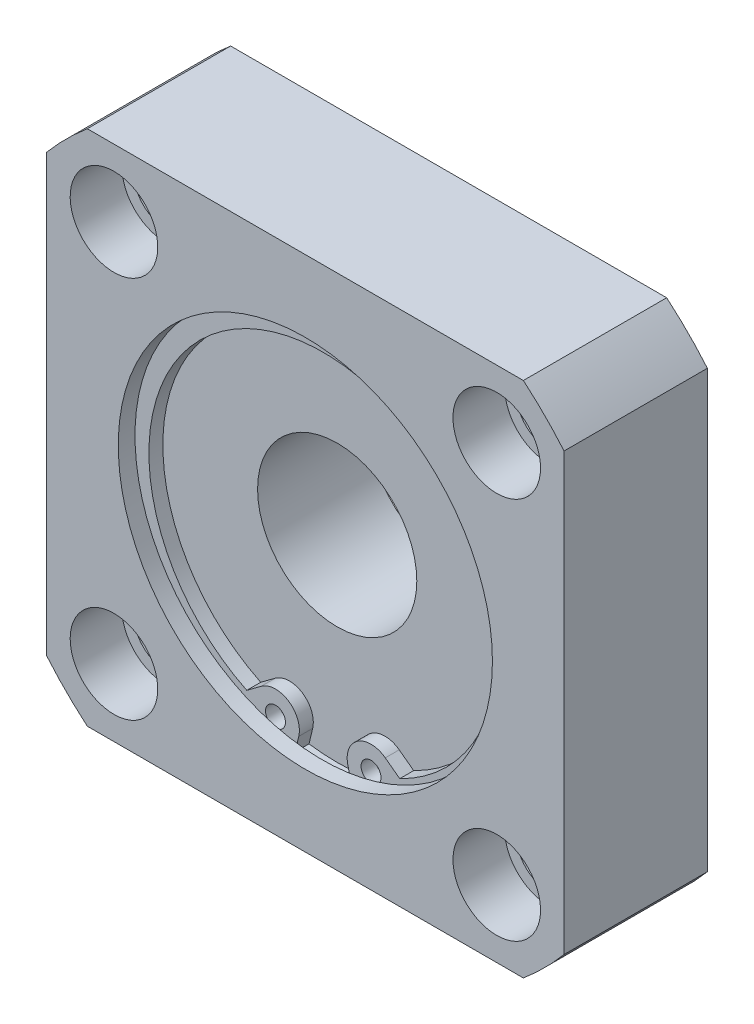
ISO-10303-21;
HEADER;
FILE_DESCRIPTION(('STEP AP214'),'2;1');
FILE_NAME('part.step','',(''),(''),'','','');
FILE_SCHEMA(('AUTOMOTIVE_DESIGN { 1 0 10303 214 1 1 1 1 }'));
ENDSEC;
DATA;
#1=APPLICATION_CONTEXT('core data for automotive mechanical design processes');
#2=APPLICATION_PROTOCOL_DEFINITION('international standard','automotive_design',2000,#1);
#3=PRODUCT_CONTEXT('',#1,'mechanical');
#4=PRODUCT('Part','Part','',(#3));
#5=PRODUCT_RELATED_PRODUCT_CATEGORY('part','',(#4));
#6=PRODUCT_DEFINITION_FORMATION('','',#4);
#7=PRODUCT_DEFINITION_CONTEXT('part definition',#1,'design');
#8=PRODUCT_DEFINITION('design','',#6,#7);
#9=PRODUCT_DEFINITION_SHAPE('','',#8);
#10=(LENGTH_UNIT() NAMED_UNIT(*) SI_UNIT(.MILLI.,.METRE.));
#11=(NAMED_UNIT(*) PLANE_ANGLE_UNIT() SI_UNIT($,.RADIAN.));
#12=(NAMED_UNIT(*) SI_UNIT($,.STERADIAN.) SOLID_ANGLE_UNIT());
#13=UNCERTAINTY_MEASURE_WITH_UNIT(LENGTH_MEASURE(1.E-05),#10,'distance_accuracy_value','');
#14=(GEOMETRIC_REPRESENTATION_CONTEXT(3) GLOBAL_UNCERTAINTY_ASSIGNED_CONTEXT((#13)) GLOBAL_UNIT_ASSIGNED_CONTEXT((#10,
#11,#12)) REPRESENTATION_CONTEXT('',''));
#15=CARTESIAN_POINT('',(0.,0.,0.));
#16=DIRECTION('',(0.,0.,1.));
#17=DIRECTION('',(1.,0.,0.));
#18=AXIS2_PLACEMENT_3D('',#15,#16,#17);
#19=CARTESIAN_POINT('',(24.0416305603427,24.0416305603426,0.));
#20=DIRECTION('',(0.,0.,1.));
#21=DIRECTION('',(1.,0.,0.));
#22=AXIS2_PLACEMENT_3D('',#19,#20,#21);
#23=CYLINDRICAL_SURFACE('',#22,4.);
#24=CARTESIAN_POINT('',(24.0416305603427,24.0416305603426,0.));
#25=DIRECTION('',(0.,0.,1.));
#26=DIRECTION('',(1.,0.,0.));
#27=AXIS2_PLACEMENT_3D('',#24,#25,#26);
#28=CIRCLE('',#27,4.);
#29=CARTESIAN_POINT('',(28.0416305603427,24.0416305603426,0.));
#30=VERTEX_POINT('',#29);
#31=EDGE_CURVE('E275',#30,#30,#28,.T.);
#32=ORIENTED_EDGE('',*,*,#31,.F.);
#33=EDGE_LOOP('',(#32));
#34=FACE_BOUND('',#33,.T.);
#35=CARTESIAN_POINT('',(24.0416305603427,24.0416305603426,11.5));
#36=DIRECTION('',(0.,0.,1.));
#37=DIRECTION('',(1.,0.,0.));
#38=AXIS2_PLACEMENT_3D('',#35,#36,#37);
#39=CIRCLE('',#38,4.);
#40=CARTESIAN_POINT('',(28.0416305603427,24.0416305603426,11.5));
#41=VERTEX_POINT('',#40);
#42=EDGE_CURVE('E274',#41,#41,#39,.F.);
#43=ORIENTED_EDGE('',*,*,#42,.F.);
#44=EDGE_LOOP('',(#43));
#45=FACE_BOUND('',#44,.T.);
#46=ADVANCED_FACE('F14',(#34,#45),#23,.F.);
#47=CARTESIAN_POINT('',(24.0416305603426,-24.0416305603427,0.));
#48=DIRECTION('',(0.,0.,1.));
#49=DIRECTION('',(1.,0.,0.));
#50=AXIS2_PLACEMENT_3D('',#47,#48,#49);
#51=CYLINDRICAL_SURFACE('',#50,4.);
#52=CARTESIAN_POINT('',(24.0416305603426,-24.0416305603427,0.));
#53=DIRECTION('',(0.,0.,1.));
#54=DIRECTION('',(0.,-1.,0.));
#55=AXIS2_PLACEMENT_3D('',#52,#53,#54);
#56=CIRCLE('',#55,4.);
#57=CARTESIAN_POINT('',(24.0416305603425,-28.0416305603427,0.));
#58=VERTEX_POINT('',#57);
#59=EDGE_CURVE('E265',#58,#58,#56,.T.);
#60=ORIENTED_EDGE('',*,*,#59,.F.);
#61=EDGE_LOOP('',(#60));
#62=FACE_BOUND('',#61,.T.);
#63=CARTESIAN_POINT('',(24.0416305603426,-24.0416305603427,11.5));
#64=DIRECTION('',(0.,0.,1.));
#65=DIRECTION('',(1.,0.,0.));
#66=AXIS2_PLACEMENT_3D('',#63,#64,#65);
#67=CIRCLE('',#66,4.);
#68=CARTESIAN_POINT('',(28.0416305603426,-24.0416305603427,11.5));
#69=VERTEX_POINT('',#68);
#70=EDGE_CURVE('E258',#69,#69,#67,.F.);
#71=ORIENTED_EDGE('',*,*,#70,.F.);
#72=EDGE_LOOP('',(#71));
#73=FACE_BOUND('',#72,.T.);
#74=ADVANCED_FACE('F474',(#62,#73),#51,.F.);
#75=CARTESIAN_POINT('',(-24.0416305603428,-24.0416305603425,0.));
#76=DIRECTION('',(0.,0.,1.));
#77=DIRECTION('',(1.,0.,0.));
#78=AXIS2_PLACEMENT_3D('',#75,#76,#77);
#79=CYLINDRICAL_SURFACE('',#78,4.);
#80=CARTESIAN_POINT('',(-24.0416305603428,-24.0416305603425,0.));
#81=DIRECTION('',(0.,0.,1.));
#82=DIRECTION('',(-1.,0.,0.));
#83=AXIS2_PLACEMENT_3D('',#80,#81,#82);
#84=CIRCLE('',#83,4.);
#85=CARTESIAN_POINT('',(-28.0416305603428,-24.0416305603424,0.));
#86=VERTEX_POINT('',#85);
#87=EDGE_CURVE('E262',#86,#86,#84,.T.);
#88=ORIENTED_EDGE('',*,*,#87,.F.);
#89=EDGE_LOOP('',(#88));
#90=FACE_BOUND('',#89,.T.);
#91=CARTESIAN_POINT('',(-24.0416305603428,-24.0416305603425,11.5));
#92=DIRECTION('',(0.,0.,1.));
#93=DIRECTION('',(1.,0.,0.));
#94=AXIS2_PLACEMENT_3D('',#91,#92,#93);
#95=CIRCLE('',#94,4.);
#96=CARTESIAN_POINT('',(-20.0416305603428,-24.0416305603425,11.5));
#97=VERTEX_POINT('',#96);
#98=EDGE_CURVE('E251',#97,#97,#95,.F.);
#99=ORIENTED_EDGE('',*,*,#98,.F.);
#100=EDGE_LOOP('',(#99));
#101=FACE_BOUND('',#100,.T.);
#102=ADVANCED_FACE('F486',(#90,#101),#79,.F.);
#103=CARTESIAN_POINT('',(-24.0416305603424,24.0416305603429,0.));
#104=DIRECTION('',(0.,0.,1.));
#105=DIRECTION('',(1.,0.,0.));
#106=AXIS2_PLACEMENT_3D('',#103,#104,#105);
#107=CYLINDRICAL_SURFACE('',#106,4.);
#108=CARTESIAN_POINT('',(-24.0416305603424,24.0416305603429,0.));
#109=DIRECTION('',(0.,0.,1.));
#110=DIRECTION('',(0.,1.,0.));
#111=AXIS2_PLACEMENT_3D('',#108,#109,#110);
#112=CIRCLE('',#111,4.);
#113=CARTESIAN_POINT('',(-24.0416305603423,28.0416305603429,0.));
#114=VERTEX_POINT('',#113);
#115=EDGE_CURVE('E259',#114,#114,#112,.T.);
#116=ORIENTED_EDGE('',*,*,#115,.F.);
#117=EDGE_LOOP('',(#116));
#118=FACE_BOUND('',#117,.T.);
#119=CARTESIAN_POINT('',(-24.0416305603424,24.0416305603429,11.5));
#120=DIRECTION('',(0.,0.,1.));
#121=DIRECTION('',(1.,0.,0.));
#122=AXIS2_PLACEMENT_3D('',#119,#120,#121);
#123=CIRCLE('',#122,4.);
#124=CARTESIAN_POINT('',(-20.0416305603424,24.0416305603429,11.5));
#125=VERTEX_POINT('',#124);
#126=EDGE_CURVE('E244',#125,#125,#123,.F.);
#127=ORIENTED_EDGE('',*,*,#126,.F.);
#128=EDGE_LOOP('',(#127));
#129=FACE_BOUND('',#128,.T.);
#130=ADVANCED_FACE('F490',(#118,#129),#107,.F.);
#131=CARTESIAN_POINT('',(0.,0.,-5.));
#132=DIRECTION('',(0.,0.,1.));
#133=DIRECTION('',(1.,0.,0.));
#134=AXIS2_PLACEMENT_3D('',#131,#132,#133);
#135=CYLINDRICAL_SURFACE('',#134,27.);
#136=CARTESIAN_POINT('',(0.,0.,-5.));
#137=DIRECTION('',(0.,0.,-1.));
#138=DIRECTION('',(-1.,0.,0.));
#139=AXIS2_PLACEMENT_3D('',#136,#137,#138);
#140=CIRCLE('',#139,27.);
#141=CARTESIAN_POINT('',(-27.,0.,-5.));
#142=VERTEX_POINT('',#141);
#143=EDGE_CURVE('E226',#142,#142,#140,.T.);
#144=ORIENTED_EDGE('',*,*,#143,.F.);
#145=EDGE_LOOP('',(#144));
#146=FACE_BOUND('',#145,.T.);
#147=CARTESIAN_POINT('',(0.,0.,0.));
#148=DIRECTION('',(0.,0.,-1.));
#149=DIRECTION('',(-1.,0.,0.));
#150=AXIS2_PLACEMENT_3D('',#147,#148,#149);
#151=CIRCLE('',#150,27.);
#152=CARTESIAN_POINT('',(-27.,0.,0.));
#153=VERTEX_POINT('',#152);
#154=EDGE_CURVE('E227',#153,#153,#151,.T.);
#155=ORIENTED_EDGE('',*,*,#154,.T.);
#156=EDGE_LOOP('',(#155));
#157=FACE_BOUND('',#156,.T.);
#158=ADVANCED_FACE('F465',(#146,#157),#135,.T.);
#159=CARTESIAN_POINT('',(0.,0.,0.));
#160=DIRECTION('',(0.,0.,-1.));
#161=DIRECTION('',(-1.,0.,0.));
#162=AXIS2_PLACEMENT_3D('',#159,#160,#161);
#163=PLANE('',#162);
#164=ORIENTED_EDGE('',*,*,#154,.F.);
#165=EDGE_LOOP('',(#164));
#166=FACE_BOUND('',#165,.T.);
#167=ORIENTED_EDGE('',*,*,#115,.T.);
#168=EDGE_LOOP('',(#167));
#169=FACE_BOUND('',#168,.T.);
#170=ORIENTED_EDGE('',*,*,#87,.T.);
#171=EDGE_LOOP('',(#170));
#172=FACE_BOUND('',#171,.T.);
#173=ORIENTED_EDGE('',*,*,#59,.T.);
#174=EDGE_LOOP('',(#173));
#175=FACE_BOUND('',#174,.T.);
#176=ORIENTED_EDGE('',*,*,#31,.T.);
#177=EDGE_LOOP('',(#176));
#178=FACE_BOUND('',#177,.T.);
#179=CARTESIAN_POINT('',(0.,0.,0.));
#180=DIRECTION('',(0.,0.,-1.));
#181=DIRECTION('',(-1.,0.,0.));
#182=AXIS2_PLACEMENT_3D('',#179,#180,#181);
#183=CIRCLE('',#182,42.5);
#184=CARTESIAN_POINT('',(32.5,-27.3861278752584,0.));
#185=VERTEX_POINT('',#184);
#186=CARTESIAN_POINT('',(27.3861278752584,-32.5,0.));
#187=VERTEX_POINT('',#186);
#188=EDGE_CURVE('E281',#185,#187,#183,.T.);
#189=ORIENTED_EDGE('',*,*,#188,.T.);
#190=DIRECTION('',(1.,0.,0.));
#191=VECTOR('',#190,1.);
#192=CARTESIAN_POINT('',(-27.3861278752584,-32.5,0.));
#193=LINE('',#192,#191);
#194=CARTESIAN_POINT('',(-27.3861278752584,-32.5,0.));
#195=VERTEX_POINT('',#194);
#196=EDGE_CURVE('E283',#195,#187,#193,.T.);
#197=ORIENTED_EDGE('',*,*,#196,.F.);
#198=CARTESIAN_POINT('',(0.,0.,0.));
#199=DIRECTION('',(0.,0.,1.));
#200=DIRECTION('',(1.,0.,0.));
#201=AXIS2_PLACEMENT_3D('',#198,#199,#200);
#202=CIRCLE('',#201,42.5);
#203=CARTESIAN_POINT('',(-32.5,-27.3861278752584,0.));
#204=VERTEX_POINT('',#203);
#205=EDGE_CURVE('E286',#204,#195,#202,.T.);
#206=ORIENTED_EDGE('',*,*,#205,.F.);
#207=DIRECTION('',(0.,-1.,0.));
#208=VECTOR('',#207,1.);
#209=CARTESIAN_POINT('',(-32.5,27.3861278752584,0.));
#210=LINE('',#209,#208);
#211=CARTESIAN_POINT('',(-32.5,27.3861278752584,0.));
#212=VERTEX_POINT('',#211);
#213=EDGE_CURVE('E289',#212,#204,#210,.T.);
#214=ORIENTED_EDGE('',*,*,#213,.F.);
#215=CARTESIAN_POINT('',(0.,0.,0.));
#216=DIRECTION('',(0.,0.,-1.));
#217=DIRECTION('',(-1.,0.,0.));
#218=AXIS2_PLACEMENT_3D('',#215,#216,#217);
#219=CIRCLE('',#218,42.5);
#220=CARTESIAN_POINT('',(-27.3861278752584,32.5,0.));
#221=VERTEX_POINT('',#220);
#222=EDGE_CURVE('E292',#212,#221,#219,.T.);
#223=ORIENTED_EDGE('',*,*,#222,.T.);
#224=DIRECTION('',(1.,0.,0.));
#225=VECTOR('',#224,1.);
#226=CARTESIAN_POINT('',(-27.3861278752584,32.5,0.));
#227=LINE('',#226,#225);
#228=CARTESIAN_POINT('',(27.3861278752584,32.5,0.));
#229=VERTEX_POINT('',#228);
#230=EDGE_CURVE('E295',#221,#229,#227,.T.);
#231=ORIENTED_EDGE('',*,*,#230,.T.);
#232=CARTESIAN_POINT('',(0.,0.,0.));
#233=DIRECTION('',(0.,0.,1.));
#234=DIRECTION('',(1.,0.,0.));
#235=AXIS2_PLACEMENT_3D('',#232,#233,#234);
#236=CIRCLE('',#235,42.5);
#237=CARTESIAN_POINT('',(32.5,27.3861278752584,0.));
#238=VERTEX_POINT('',#237);
#239=EDGE_CURVE('E298',#238,#229,#236,.T.);
#240=ORIENTED_EDGE('',*,*,#239,.F.);
#241=DIRECTION('',(0.,-1.,0.));
#242=VECTOR('',#241,1.);
#243=CARTESIAN_POINT('',(32.5,27.3861278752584,0.));
#244=LINE('',#243,#242);
#245=EDGE_CURVE('E301',#238,#185,#244,.T.);
#246=ORIENTED_EDGE('',*,*,#245,.T.);
#247=EDGE_LOOP('',(#189,#197,#206,#214,#223,#231,#240,#246));
#248=FACE_BOUND('',#247,.T.);
#249=ADVANCED_FACE('F461',(#166,#169,#172,#175,#178,#248),#163,.T.);
#250=CARTESIAN_POINT('',(24.0416305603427,24.0416305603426,11.5));
#251=DIRECTION('',(0.,0.,1.));
#252=DIRECTION('',(1.,0.,0.));
#253=AXIS2_PLACEMENT_3D('',#250,#251,#252);
#254=PLANE('',#253);
#255=CARTESIAN_POINT('',(24.0416305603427,24.0416305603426,11.5));
#256=DIRECTION('',(0.,0.,1.));
#257=DIRECTION('',(1.,0.,0.));
#258=AXIS2_PLACEMENT_3D('',#255,#256,#257);
#259=CIRCLE('',#258,5.5);
#260=CARTESIAN_POINT('',(29.5416305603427,24.0416305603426,11.5));
#261=VERTEX_POINT('',#260);
#262=EDGE_CURVE('E271',#261,#261,#259,.T.);
#263=ORIENTED_EDGE('',*,*,#262,.T.);
#264=EDGE_LOOP('',(#263));
#265=FACE_BOUND('',#264,.T.);
#266=ORIENTED_EDGE('',*,*,#42,.T.);
#267=EDGE_LOOP('',(#266));
#268=FACE_BOUND('',#267,.T.);
#269=ADVANCED_FACE('F464',(#265,#268),#254,.T.);
#270=CARTESIAN_POINT('',(24.0416305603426,-24.0416305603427,11.5));
#271=DIRECTION('',(0.,0.,1.));
#272=DIRECTION('',(0.,-1.,0.));
#273=AXIS2_PLACEMENT_3D('',#270,#271,#272);
#274=PLANE('',#273);
#275=CARTESIAN_POINT('',(24.0416305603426,-24.0416305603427,11.5));
#276=DIRECTION('',(0.,0.,1.));
#277=DIRECTION('',(0.,-1.,0.));
#278=AXIS2_PLACEMENT_3D('',#275,#276,#277);
#279=CIRCLE('',#278,5.5);
#280=CARTESIAN_POINT('',(24.0416305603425,-29.5416305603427,11.5));
#281=VERTEX_POINT('',#280);
#282=EDGE_CURVE('E255',#281,#281,#279,.T.);
#283=ORIENTED_EDGE('',*,*,#282,.T.);
#284=EDGE_LOOP('',(#283));
#285=FACE_BOUND('',#284,.T.);
#286=ORIENTED_EDGE('',*,*,#70,.T.);
#287=EDGE_LOOP('',(#286));
#288=FACE_BOUND('',#287,.T.);
#289=ADVANCED_FACE('F482',(#285,#288),#274,.T.);
#290=CARTESIAN_POINT('',(-24.0416305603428,-24.0416305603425,11.5));
#291=DIRECTION('',(0.,0.,1.));
#292=DIRECTION('',(-1.,0.,0.));
#293=AXIS2_PLACEMENT_3D('',#290,#291,#292);
#294=PLANE('',#293);
#295=CARTESIAN_POINT('',(-24.0416305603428,-24.0416305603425,11.5));
#296=DIRECTION('',(0.,0.,1.));
#297=DIRECTION('',(-1.,0.,0.));
#298=AXIS2_PLACEMENT_3D('',#295,#296,#297);
#299=CIRCLE('',#298,5.5);
#300=CARTESIAN_POINT('',(-29.5416305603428,-24.0416305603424,11.5));
#301=VERTEX_POINT('',#300);
#302=EDGE_CURVE('E248',#301,#301,#299,.T.);
#303=ORIENTED_EDGE('',*,*,#302,.T.);
#304=EDGE_LOOP('',(#303));
#305=FACE_BOUND('',#304,.T.);
#306=ORIENTED_EDGE('',*,*,#98,.T.);
#307=EDGE_LOOP('',(#306));
#308=FACE_BOUND('',#307,.T.);
#309=ADVANCED_FACE('F501',(#305,#308),#294,.T.);
#310=CARTESIAN_POINT('',(-24.0416305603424,24.0416305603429,11.5));
#311=DIRECTION('',(0.,0.,1.));
#312=DIRECTION('',(0.,1.,0.));
#313=AXIS2_PLACEMENT_3D('',#310,#311,#312);
#314=PLANE('',#313);
#315=CARTESIAN_POINT('',(-24.0416305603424,24.0416305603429,11.5));
#316=DIRECTION('',(0.,0.,1.));
#317=DIRECTION('',(0.,1.,0.));
#318=AXIS2_PLACEMENT_3D('',#315,#316,#317);
#319=CIRCLE('',#318,5.5);
#320=CARTESIAN_POINT('',(-24.0416305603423,29.5416305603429,11.5));
#321=VERTEX_POINT('',#320);
#322=EDGE_CURVE('E241',#321,#321,#319,.T.);
#323=ORIENTED_EDGE('',*,*,#322,.T.);
#324=EDGE_LOOP('',(#323));
#325=FACE_BOUND('',#324,.T.);
#326=ORIENTED_EDGE('',*,*,#126,.T.);
#327=EDGE_LOOP('',(#326));
#328=FACE_BOUND('',#327,.T.);
#329=ADVANCED_FACE('F509',(#325,#328),#314,.T.);
#330=CARTESIAN_POINT('',(0.,0.,-5.));
#331=DIRECTION('',(0.,0.,-1.));
#332=DIRECTION('',(-1.,0.,0.));
#333=AXIS2_PLACEMENT_3D('',#330,#331,#332);
#334=PLANE('',#333);
#335=ORIENTED_EDGE('',*,*,#143,.T.);
#336=EDGE_LOOP('',(#335));
#337=FACE_BOUND('',#336,.T.);
#338=CARTESIAN_POINT('',(0.,0.,-5.));
#339=DIRECTION('',(0.,0.,-1.));
#340=DIRECTION('',(-1.,0.,0.));
#341=AXIS2_PLACEMENT_3D('',#338,#339,#340);
#342=CIRCLE('',#341,20.);
#343=CARTESIAN_POINT('',(-20.,0.,-5.));
#344=VERTEX_POINT('',#343);
#345=EDGE_CURVE('E223',#344,#344,#342,.T.);
#346=ORIENTED_EDGE('',*,*,#345,.F.);
#347=EDGE_LOOP('',(#346));
#348=FACE_BOUND('',#347,.T.);
#349=ADVANCED_FACE('F450',(#337,#348),#334,.T.);
#350=CARTESIAN_POINT('',(-27.3861278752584,-32.5,18.));
#351=DIRECTION('',(0.,1.,0.));
#352=DIRECTION('',(0.,0.,1.));
#353=AXIS2_PLACEMENT_3D('',#350,#351,#352);
#354=PLANE('',#353);
#355=DIRECTION('',(1.,0.,0.));
#356=VECTOR('',#355,1.);
#357=CARTESIAN_POINT('',(-27.3861278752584,-32.5,18.));
#358=LINE('',#357,#356);
#359=CARTESIAN_POINT('',(-27.3861278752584,-32.5,18.));
#360=VERTEX_POINT('',#359);
#361=CARTESIAN_POINT('',(27.3861278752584,-32.5,18.));
#362=VERTEX_POINT('',#361);
#363=EDGE_CURVE('E306',#360,#362,#358,.T.);
#364=ORIENTED_EDGE('',*,*,#363,.F.);
#365=DIRECTION('',(0.,0.,-1.));
#366=VECTOR('',#365,1.);
#367=CARTESIAN_POINT('',(-27.3861278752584,-32.5,18.));
#368=LINE('',#367,#366);
#369=EDGE_CURVE('E328',#360,#195,#368,.T.);
#370=ORIENTED_EDGE('',*,*,#369,.T.);
#371=ORIENTED_EDGE('',*,*,#196,.T.);
#372=DIRECTION('',(0.,0.,-1.));
#373=VECTOR('',#372,1.);
#374=CARTESIAN_POINT('',(27.3861278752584,-32.5,18.));
#375=LINE('',#374,#373);
#376=EDGE_CURVE('E74',#362,#187,#375,.T.);
#377=ORIENTED_EDGE('',*,*,#376,.F.);
#378=EDGE_LOOP('',(#364,#370,#371,#377));
#379=FACE_BOUND('',#378,.T.);
#380=ADVANCED_FACE('F446',(#379),#354,.F.);
#381=CARTESIAN_POINT('',(0.,0.,18.));
#382=DIRECTION('',(0.,0.,-1.));
#383=DIRECTION('',(-1.,0.,0.));
#384=AXIS2_PLACEMENT_3D('',#381,#382,#383);
#385=CYLINDRICAL_SURFACE('',#384,42.5);
#386=ORIENTED_EDGE('',*,*,#369,.F.);
#387=CARTESIAN_POINT('',(0.,0.,18.));
#388=DIRECTION('',(0.,0.,1.));
#389=DIRECTION('',(1.,0.,0.));
#390=AXIS2_PLACEMENT_3D('',#387,#388,#389);
#391=CIRCLE('',#390,42.5);
#392=CARTESIAN_POINT('',(-32.5,-27.3861278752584,18.));
#393=VERTEX_POINT('',#392);
#394=EDGE_CURVE('E309',#393,#360,#391,.T.);
#395=ORIENTED_EDGE('',*,*,#394,.F.);
#396=DIRECTION('',(0.,0.,-1.));
#397=VECTOR('',#396,1.);
#398=CARTESIAN_POINT('',(-32.5,-27.3861278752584,18.));
#399=LINE('',#398,#397);
#400=EDGE_CURVE('E330',#393,#204,#399,.T.);
#401=ORIENTED_EDGE('',*,*,#400,.T.);
#402=ORIENTED_EDGE('',*,*,#205,.T.);
#403=EDGE_LOOP('',(#386,#395,#401,#402));
#404=FACE_BOUND('',#403,.T.);
#405=ADVANCED_FACE('F442',(#404),#385,.T.);
#406=CARTESIAN_POINT('',(-32.5,27.3861278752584,18.));
#407=DIRECTION('',(1.,0.,0.));
#408=DIRECTION('',(0.,0.,-1.));
#409=AXIS2_PLACEMENT_3D('',#406,#407,#408);
#410=PLANE('',#409);
#411=ORIENTED_EDGE('',*,*,#400,.F.);
#412=DIRECTION('',(0.,-1.,0.));
#413=VECTOR('',#412,1.);
#414=CARTESIAN_POINT('',(-32.5,27.3861278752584,18.));
#415=LINE('',#414,#413);
#416=CARTESIAN_POINT('',(-32.5,27.3861278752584,18.));
#417=VERTEX_POINT('',#416);
#418=EDGE_CURVE('E312',#417,#393,#415,.T.);
#419=ORIENTED_EDGE('',*,*,#418,.F.);
#420=DIRECTION('',(0.,0.,-1.));
#421=VECTOR('',#420,1.);
#422=CARTESIAN_POINT('',(-32.5,27.3861278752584,18.));
#423=LINE('',#422,#421);
#424=EDGE_CURVE('E332',#417,#212,#423,.T.);
#425=ORIENTED_EDGE('',*,*,#424,.T.);
#426=ORIENTED_EDGE('',*,*,#213,.T.);
#427=EDGE_LOOP('',(#411,#419,#425,#426));
#428=FACE_BOUND('',#427,.T.);
#429=ADVANCED_FACE('F438',(#428),#410,.F.);
#430=CARTESIAN_POINT('',(0.,0.,18.));
#431=DIRECTION('',(0.,0.,-1.));
#432=DIRECTION('',(-1.,0.,0.));
#433=AXIS2_PLACEMENT_3D('',#430,#431,#432);
#434=CYLINDRICAL_SURFACE('',#433,42.5);
#435=ORIENTED_EDGE('',*,*,#424,.F.);
#436=CARTESIAN_POINT('',(0.,0.,18.));
#437=DIRECTION('',(0.,0.,-1.));
#438=DIRECTION('',(-1.,0.,0.));
#439=AXIS2_PLACEMENT_3D('',#436,#437,#438);
#440=CIRCLE('',#439,42.5);
#441=CARTESIAN_POINT('',(-27.3861278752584,32.5,18.));
#442=VERTEX_POINT('',#441);
#443=EDGE_CURVE('E315',#417,#442,#440,.T.);
#444=ORIENTED_EDGE('',*,*,#443,.T.);
#445=DIRECTION('',(0.,0.,-1.));
#446=VECTOR('',#445,1.);
#447=CARTESIAN_POINT('',(-27.3861278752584,32.5,18.));
#448=LINE('',#447,#446);
#449=EDGE_CURVE('E334',#442,#221,#448,.T.);
#450=ORIENTED_EDGE('',*,*,#449,.T.);
#451=ORIENTED_EDGE('',*,*,#222,.F.);
#452=EDGE_LOOP('',(#435,#444,#450,#451));
#453=FACE_BOUND('',#452,.T.);
#454=ADVANCED_FACE('F434',(#453),#434,.T.);
#455=CARTESIAN_POINT('',(-27.3861278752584,32.5,18.));
#456=DIRECTION('',(0.,1.,0.));
#457=DIRECTION('',(0.,0.,1.));
#458=AXIS2_PLACEMENT_3D('',#455,#456,#457);
#459=PLANE('',#458);
#460=ORIENTED_EDGE('',*,*,#449,.F.);
#461=DIRECTION('',(1.,0.,0.));
#462=VECTOR('',#461,1.);
#463=CARTESIAN_POINT('',(-27.3861278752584,32.5,18.));
#464=LINE('',#463,#462);
#465=CARTESIAN_POINT('',(27.3861278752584,32.5,18.));
#466=VERTEX_POINT('',#465);
#467=EDGE_CURVE('E318',#442,#466,#464,.T.);
#468=ORIENTED_EDGE('',*,*,#467,.T.);
#469=DIRECTION('',(0.,0.,-1.));
#470=VECTOR('',#469,1.);
#471=CARTESIAN_POINT('',(27.3861278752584,32.5,18.));
#472=LINE('',#471,#470);
#473=EDGE_CURVE('E336',#466,#229,#472,.T.);
#474=ORIENTED_EDGE('',*,*,#473,.T.);
#475=ORIENTED_EDGE('',*,*,#230,.F.);
#476=EDGE_LOOP('',(#460,#468,#474,#475));
#477=FACE_BOUND('',#476,.T.);
#478=ADVANCED_FACE('F430',(#477),#459,.T.);
#479=CARTESIAN_POINT('',(0.,0.,18.));
#480=DIRECTION('',(0.,0.,-1.));
#481=DIRECTION('',(-1.,0.,0.));
#482=AXIS2_PLACEMENT_3D('',#479,#480,#481);
#483=CYLINDRICAL_SURFACE('',#482,42.5);
#484=ORIENTED_EDGE('',*,*,#473,.F.);
#485=CARTESIAN_POINT('',(0.,0.,18.));
#486=DIRECTION('',(0.,0.,1.));
#487=DIRECTION('',(1.,0.,0.));
#488=AXIS2_PLACEMENT_3D('',#485,#486,#487);
#489=CIRCLE('',#488,42.5);
#490=CARTESIAN_POINT('',(32.5,27.3861278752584,18.));
#491=VERTEX_POINT('',#490);
#492=EDGE_CURVE('E321',#491,#466,#489,.T.);
#493=ORIENTED_EDGE('',*,*,#492,.F.);
#494=DIRECTION('',(0.,0.,-1.));
#495=VECTOR('',#494,1.);
#496=CARTESIAN_POINT('',(32.5,27.3861278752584,18.));
#497=LINE('',#496,#495);
#498=EDGE_CURVE('E338',#491,#238,#497,.T.);
#499=ORIENTED_EDGE('',*,*,#498,.T.);
#500=ORIENTED_EDGE('',*,*,#239,.T.);
#501=EDGE_LOOP('',(#484,#493,#499,#500));
#502=FACE_BOUND('',#501,.T.);
#503=ADVANCED_FACE('F426',(#502),#483,.T.);
#504=CARTESIAN_POINT('',(32.5,27.3861278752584,18.));
#505=DIRECTION('',(1.,0.,0.));
#506=DIRECTION('',(0.,0.,-1.));
#507=AXIS2_PLACEMENT_3D('',#504,#505,#506);
#508=PLANE('',#507);
#509=ORIENTED_EDGE('',*,*,#498,.F.);
#510=DIRECTION('',(0.,-1.,0.));
#511=VECTOR('',#510,1.);
#512=CARTESIAN_POINT('',(32.5,27.3861278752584,18.));
#513=LINE('',#512,#511);
#514=CARTESIAN_POINT('',(32.5,-27.3861278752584,18.));
#515=VERTEX_POINT('',#514);
#516=EDGE_CURVE('E324',#491,#515,#513,.T.);
#517=ORIENTED_EDGE('',*,*,#516,.T.);
#518=DIRECTION('',(0.,0.,-1.));
#519=VECTOR('',#518,1.);
#520=CARTESIAN_POINT('',(32.5,-27.3861278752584,18.));
#521=LINE('',#520,#519);
#522=EDGE_CURVE('E231',#515,#185,#521,.T.);
#523=ORIENTED_EDGE('',*,*,#522,.T.);
#524=ORIENTED_EDGE('',*,*,#245,.F.);
#525=EDGE_LOOP('',(#509,#517,#523,#524));
#526=FACE_BOUND('',#525,.T.);
#527=ADVANCED_FACE('F422',(#526),#508,.T.);
#528=CARTESIAN_POINT('',(0.,0.,18.));
#529=DIRECTION('',(0.,0.,-1.));
#530=DIRECTION('',(-1.,0.,0.));
#531=AXIS2_PLACEMENT_3D('',#528,#529,#530);
#532=CYLINDRICAL_SURFACE('',#531,42.5);
#533=ORIENTED_EDGE('',*,*,#522,.F.);
#534=CARTESIAN_POINT('',(0.,0.,18.));
#535=DIRECTION('',(0.,0.,-1.));
#536=DIRECTION('',(-1.,0.,0.));
#537=AXIS2_PLACEMENT_3D('',#534,#535,#536);
#538=CIRCLE('',#537,42.5);
#539=EDGE_CURVE('E304',#515,#362,#538,.T.);
#540=ORIENTED_EDGE('',*,*,#539,.T.);
#541=ORIENTED_EDGE('',*,*,#376,.T.);
#542=ORIENTED_EDGE('',*,*,#188,.F.);
#543=EDGE_LOOP('',(#533,#540,#541,#542));
#544=FACE_BOUND('',#543,.T.);
#545=ADVANCED_FACE('F425',(#544),#532,.T.);
#546=CARTESIAN_POINT('',(24.0416305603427,24.0416305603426,11.5));
#547=DIRECTION('',(0.,0.,1.));
#548=DIRECTION('',(1.,0.,0.));
#549=AXIS2_PLACEMENT_3D('',#546,#547,#548);
#550=CYLINDRICAL_SURFACE('',#549,5.5);
#551=ORIENTED_EDGE('',*,*,#262,.F.);
#552=EDGE_LOOP('',(#551));
#553=FACE_BOUND('',#552,.T.);
#554=CARTESIAN_POINT('',(24.0416305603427,24.0416305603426,18.));
#555=DIRECTION('',(0.,0.,1.));
#556=DIRECTION('',(1.,0.,0.));
#557=AXIS2_PLACEMENT_3D('',#554,#555,#556);
#558=CIRCLE('',#557,5.5);
#559=CARTESIAN_POINT('',(29.5416305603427,24.0416305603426,18.));
#560=VERTEX_POINT('',#559);
#561=EDGE_CURVE('E268',#560,#560,#558,.T.);
#562=ORIENTED_EDGE('',*,*,#561,.T.);
#563=EDGE_LOOP('',(#562));
#564=FACE_BOUND('',#563,.T.);
#565=ADVANCED_FACE('F454',(#553,#564),#550,.F.);
#566=CARTESIAN_POINT('',(24.0416305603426,-24.0416305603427,11.5));
#567=DIRECTION('',(0.,0.,1.));
#568=DIRECTION('',(1.,0.,0.));
#569=AXIS2_PLACEMENT_3D('',#566,#567,#568);
#570=CYLINDRICAL_SURFACE('',#569,5.5);
#571=ORIENTED_EDGE('',*,*,#282,.F.);
#572=EDGE_LOOP('',(#571));
#573=FACE_BOUND('',#572,.T.);
#574=CARTESIAN_POINT('',(24.0416305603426,-24.0416305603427,18.));
#575=DIRECTION('',(0.,0.,1.));
#576=DIRECTION('',(0.,-1.,0.));
#577=AXIS2_PLACEMENT_3D('',#574,#575,#576);
#578=CIRCLE('',#577,5.5);
#579=CARTESIAN_POINT('',(24.0416305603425,-29.5416305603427,18.));
#580=VERTEX_POINT('',#579);
#581=EDGE_CURVE('E252',#580,#580,#578,.T.);
#582=ORIENTED_EDGE('',*,*,#581,.T.);
#583=EDGE_LOOP('',(#582));
#584=FACE_BOUND('',#583,.T.);
#585=ADVANCED_FACE('F478',(#573,#584),#570,.F.);
#586=CARTESIAN_POINT('',(-24.0416305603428,-24.0416305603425,11.5));
#587=DIRECTION('',(0.,0.,1.));
#588=DIRECTION('',(1.,0.,0.));
#589=AXIS2_PLACEMENT_3D('',#586,#587,#588);
#590=CYLINDRICAL_SURFACE('',#589,5.5);
#591=ORIENTED_EDGE('',*,*,#302,.F.);
#592=EDGE_LOOP('',(#591));
#593=FACE_BOUND('',#592,.T.);
#594=CARTESIAN_POINT('',(-24.0416305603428,-24.0416305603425,18.));
#595=DIRECTION('',(0.,0.,1.));
#596=DIRECTION('',(-1.,0.,0.));
#597=AXIS2_PLACEMENT_3D('',#594,#595,#596);
#598=CIRCLE('',#597,5.5);
#599=CARTESIAN_POINT('',(-29.5416305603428,-24.0416305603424,18.));
#600=VERTEX_POINT('',#599);
#601=EDGE_CURVE('E245',#600,#600,#598,.T.);
#602=ORIENTED_EDGE('',*,*,#601,.T.);
#603=EDGE_LOOP('',(#602));
#604=FACE_BOUND('',#603,.T.);
#605=ADVANCED_FACE('F497',(#593,#604),#590,.F.);
#606=CARTESIAN_POINT('',(-24.0416305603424,24.0416305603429,11.5));
#607=DIRECTION('',(0.,0.,1.));
#608=DIRECTION('',(1.,0.,0.));
#609=AXIS2_PLACEMENT_3D('',#606,#607,#608);
#610=CYLINDRICAL_SURFACE('',#609,5.5);
#611=ORIENTED_EDGE('',*,*,#322,.F.);
#612=EDGE_LOOP('',(#611));
#613=FACE_BOUND('',#612,.T.);
#614=CARTESIAN_POINT('',(-24.0416305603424,24.0416305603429,18.));
#615=DIRECTION('',(0.,0.,1.));
#616=DIRECTION('',(0.,1.,0.));
#617=AXIS2_PLACEMENT_3D('',#614,#615,#616);
#618=CIRCLE('',#617,5.5);
#619=CARTESIAN_POINT('',(-24.0416305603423,29.5416305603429,18.));
#620=VERTEX_POINT('',#619);
#621=EDGE_CURVE('E238',#620,#620,#618,.T.);
#622=ORIENTED_EDGE('',*,*,#621,.T.);
#623=EDGE_LOOP('',(#622));
#624=FACE_BOUND('',#623,.T.);
#625=ADVANCED_FACE('F505',(#613,#624),#610,.F.);
#626=CARTESIAN_POINT('',(0.,0.,-5.));
#627=DIRECTION('',(0.,0.,1.));
#628=DIRECTION('',(1.,0.,0.));
#629=AXIS2_PLACEMENT_3D('',#626,#627,#628);
#630=CYLINDRICAL_SURFACE('',#629,20.);
#631=ORIENTED_EDGE('',*,*,#345,.T.);
#632=EDGE_LOOP('',(#631));
#633=FACE_BOUND('',#632,.T.);
#634=CARTESIAN_POINT('',(0.,0.,0.));
#635=DIRECTION('',(0.,0.,-1.));
#636=DIRECTION('',(-1.,0.,0.));
#637=AXIS2_PLACEMENT_3D('',#634,#635,#636);
#638=CIRCLE('',#637,20.);
#639=CARTESIAN_POINT('',(-20.,0.,0.));
#640=VERTEX_POINT('',#639);
#641=EDGE_CURVE('E220',#640,#640,#638,.T.);
#642=ORIENTED_EDGE('',*,*,#641,.F.);
#643=EDGE_LOOP('',(#642));
#644=FACE_BOUND('',#643,.T.);
#645=ADVANCED_FACE('F459',(#633,#644),#630,.F.);
#646=CARTESIAN_POINT('',(0.,0.,18.));
#647=DIRECTION('',(0.,0.,-1.));
#648=DIRECTION('',(-1.,0.,0.));
#649=AXIS2_PLACEMENT_3D('',#646,#647,#648);
#650=PLANE('',#649);
#651=CARTESIAN_POINT('',(0.,0.,18.));
#652=DIRECTION('',(0.,0.,1.));
#653=DIRECTION('',(1.,0.,0.));
#654=AXIS2_PLACEMENT_3D('',#651,#652,#653);
#655=CIRCLE('',#654,23.5);
#656=CARTESIAN_POINT('',(23.5,0.,18.));
#657=VERTEX_POINT('',#656);
#658=EDGE_CURVE('E234',#657,#657,#655,.T.);
#659=ORIENTED_EDGE('',*,*,#658,.F.);
#660=EDGE_LOOP('',(#659));
#661=FACE_BOUND('',#660,.T.);
#662=ORIENTED_EDGE('',*,*,#621,.F.);
#663=EDGE_LOOP('',(#662));
#664=FACE_BOUND('',#663,.T.);
#665=ORIENTED_EDGE('',*,*,#601,.F.);
#666=EDGE_LOOP('',(#665));
#667=FACE_BOUND('',#666,.T.);
#668=ORIENTED_EDGE('',*,*,#581,.F.);
#669=EDGE_LOOP('',(#668));
#670=FACE_BOUND('',#669,.T.);
#671=ORIENTED_EDGE('',*,*,#561,.F.);
#672=EDGE_LOOP('',(#671));
#673=FACE_BOUND('',#672,.T.);
#674=ORIENTED_EDGE('',*,*,#539,.F.);
#675=ORIENTED_EDGE('',*,*,#516,.F.);
#676=ORIENTED_EDGE('',*,*,#492,.T.);
#677=ORIENTED_EDGE('',*,*,#467,.F.);
#678=ORIENTED_EDGE('',*,*,#443,.F.);
#679=ORIENTED_EDGE('',*,*,#418,.T.);
#680=ORIENTED_EDGE('',*,*,#394,.T.);
#681=ORIENTED_EDGE('',*,*,#363,.T.);
#682=EDGE_LOOP('',(#674,#675,#676,#677,#678,#679,#680,#681));
#683=FACE_BOUND('',#682,.T.);
#684=ADVANCED_FACE('F455',(#661,#664,#667,#670,#673,#683),#650,.F.);
#685=CARTESIAN_POINT('',(0.,0.,0.));
#686=DIRECTION('',(0.,0.,1.));
#687=DIRECTION('',(1.,0.,0.));
#688=AXIS2_PLACEMENT_3D('',#685,#686,#687);
#689=CIRCLE('',#688,10.);
#690=CARTESIAN_POINT('',(10.,0.,0.));
#691=VERTEX_POINT('',#690);
#692=EDGE_CURVE('E278',#691,#691,#689,.T.);
#693=ORIENTED_EDGE('',*,*,#692,.T.);
#694=EDGE_LOOP('',(#693));
#695=FACE_BOUND('',#694,.T.);
#696=ORIENTED_EDGE('',*,*,#641,.T.);
#697=EDGE_LOOP('',(#696));
#698=FACE_BOUND('',#697,.T.);
#699=ADVANCED_FACE('F458',(#695,#698),#163,.T.);
#700=CARTESIAN_POINT('',(0.,0.,14.));
#701=DIRECTION('',(0.,0.,1.));
#702=DIRECTION('',(1.,0.,0.));
#703=AXIS2_PLACEMENT_3D('',#700,#701,#702);
#704=CYLINDRICAL_SURFACE('',#703,23.5);
#705=CARTESIAN_POINT('',(0.,0.,15.9));
#706=DIRECTION('',(0.,0.,1.));
#707=DIRECTION('',(1.,0.,0.));
#708=AXIS2_PLACEMENT_3D('',#705,#706,#707);
#709=CIRCLE('',#708,23.5);
#710=CARTESIAN_POINT('',(23.5,0.,15.9));
#711=VERTEX_POINT('',#710);
#712=EDGE_CURVE('E217',#711,#711,#709,.F.);
#713=ORIENTED_EDGE('',*,*,#712,.T.);
#714=EDGE_LOOP('',(#713));
#715=FACE_BOUND('',#714,.T.);
#716=ORIENTED_EDGE('',*,*,#658,.T.);
#717=EDGE_LOOP('',(#716));
#718=FACE_BOUND('',#717,.T.);
#719=ADVANCED_FACE('F470',(#715,#718),#704,.F.);
#720=CARTESIAN_POINT('',(0.,0.,18.));
#721=DIRECTION('',(0.,0.,-1.));
#722=DIRECTION('',(-1.,0.,0.));
#723=AXIS2_PLACEMENT_3D('',#720,#721,#722);
#724=CYLINDRICAL_SURFACE('',#723,10.);
#725=ORIENTED_EDGE('',*,*,#692,.F.);
#726=EDGE_LOOP('',(#725));
#727=FACE_BOUND('',#726,.T.);
#728=CARTESIAN_POINT('',(0.,0.,14.));
#729=DIRECTION('',(0.,0.,1.));
#730=DIRECTION('',(1.,0.,0.));
#731=AXIS2_PLACEMENT_3D('',#728,#729,#730);
#732=CIRCLE('',#731,10.);
#733=CARTESIAN_POINT('',(10.,0.,14.));
#734=VERTEX_POINT('',#733);
#735=EDGE_CURVE('E237',#734,#734,#732,.T.);
#736=ORIENTED_EDGE('',*,*,#735,.T.);
#737=EDGE_LOOP('',(#736));
#738=FACE_BOUND('',#737,.T.);
#739=ADVANCED_FACE('F467',(#727,#738),#724,.F.);
#740=CARTESIAN_POINT('',(0.,0.,14.));
#741=DIRECTION('',(0.,0.,1.));
#742=DIRECTION('',(1.,0.,0.));
#743=AXIS2_PLACEMENT_3D('',#740,#741,#742);
#744=PLANE('',#743);
#745=ORIENTED_EDGE('',*,*,#735,.F.);
#746=EDGE_LOOP('',(#745));
#747=FACE_BOUND('',#746,.T.);
#748=CARTESIAN_POINT('',(0.,0.,14.));
#749=DIRECTION('',(0.,0.,1.));
#750=DIRECTION('',(1.,0.,0.));
#751=AXIS2_PLACEMENT_3D('',#748,#749,#750);
#752=CIRCLE('',#751,24.75);
#753=CARTESIAN_POINT('',(-3.53738888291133,-24.4959053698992,14.));
#754=VERTEX_POINT('',#753);
#755=CARTESIAN_POINT('',(3.53738888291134,-24.4959053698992,14.));
#756=VERTEX_POINT('',#755);
#757=EDGE_CURVE('E207',#754,#756,#752,.T.);
#758=ORIENTED_EDGE('',*,*,#757,.T.);
#759=DIRECTION('',(-0.231349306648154,0.972870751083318,0.));
#760=VECTOR('',#759,1.);
#761=CARTESIAN_POINT('',(-2.16530728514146,-0.514911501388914,14.));
#762=LINE('',#761,#760);
#763=CARTESIAN_POINT('',(3.08138774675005,-22.5783281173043,14.));
#764=VERTEX_POINT('',#763);
#765=EDGE_CURVE('E9',#756,#764,#762,.T.);
#766=ORIENTED_EDGE('',*,*,#765,.T.);
#767=CARTESIAN_POINT('',(6.,-21.8842801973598,14.));
#768=DIRECTION('',(0.,0.,1.));
#769=DIRECTION('',(1.,0.,0.));
#770=AXIS2_PLACEMENT_3D('',#767,#768,#769);
#771=CIRCLE('',#770,3.);
#772=CARTESIAN_POINT('',(7.7896612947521,-19.4765608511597,14.));
#773=VERTEX_POINT('',#772);
#774=EDGE_CURVE('E25',#773,#764,#771,.T.);
#775=ORIENTED_EDGE('',*,*,#774,.F.);
#776=DIRECTION('',(0.802573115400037,-0.596553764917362,0.));
#777=VECTOR('',#776,1.);
#778=CARTESIAN_POINT('',(-6.55279254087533,-8.81579403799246,14.));
#779=LINE('',#778,#777);
#780=CARTESIAN_POINT('',(9.60938951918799,-20.8291674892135,14.));
#781=VERTEX_POINT('',#780);
#782=EDGE_CURVE('E150',#773,#781,#779,.T.);
#783=ORIENTED_EDGE('',*,*,#782,.T.);
#784=CARTESIAN_POINT('',(0.,-1.15,14.));
#785=DIRECTION('',(0.,0.,1.));
#786=DIRECTION('',(1.,0.,0.));
#787=AXIS2_PLACEMENT_3D('',#784,#785,#786);
#788=CIRCLE('',#787,21.9);
#789=CARTESIAN_POINT('',(-9.60938951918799,-20.8291674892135,14.));
#790=VERTEX_POINT('',#789);
#791=EDGE_CURVE('E154',#781,#790,#788,.T.);
#792=ORIENTED_EDGE('',*,*,#791,.T.);
#793=DIRECTION('',(0.802573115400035,0.596553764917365,0.));
#794=VECTOR('',#793,1.);
#795=CARTESIAN_POINT('',(6.55279254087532,-8.81579403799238,14.));
#796=LINE('',#795,#794);
#797=CARTESIAN_POINT('',(-7.7896612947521,-19.4765608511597,14.));
#798=VERTEX_POINT('',#797);
#799=EDGE_CURVE('E169',#790,#798,#796,.T.);
#800=ORIENTED_EDGE('',*,*,#799,.T.);
#801=CARTESIAN_POINT('',(-6.,-21.8842801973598,14.));
#802=DIRECTION('',(0.,0.,1.));
#803=DIRECTION('',(1.,0.,0.));
#804=AXIS2_PLACEMENT_3D('',#801,#802,#803);
#805=CIRCLE('',#804,3.);
#806=CARTESIAN_POINT('',(-3.08138774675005,-22.5783281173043,14.));
#807=VERTEX_POINT('',#806);
#808=EDGE_CURVE('E366',#807,#798,#805,.T.);
#809=ORIENTED_EDGE('',*,*,#808,.F.);
#810=DIRECTION('',(-0.231349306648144,-0.97287075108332,0.));
#811=VECTOR('',#810,1.);
#812=CARTESIAN_POINT('',(2.16530728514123,-0.514911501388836,14.));
#813=LINE('',#812,#811);
#814=EDGE_CURVE('E369',#807,#754,#813,.T.);
#815=ORIENTED_EDGE('',*,*,#814,.T.);
#816=EDGE_LOOP('',(#758,#766,#775,#783,#792,#800,#809,#815));
#817=FACE_BOUND('',#816,.T.);
#818=ADVANCED_FACE('F153',(#747,#817),#744,.T.);
#819=CARTESIAN_POINT('',(0.,0.,15.9));
#820=DIRECTION('',(0.,0.,1.));
#821=DIRECTION('',(1.,0.,0.));
#822=AXIS2_PLACEMENT_3D('',#819,#820,#821);
#823=PLANE('',#822);
#824=CARTESIAN_POINT('',(0.,0.,15.9));
#825=DIRECTION('',(0.,0.,1.));
#826=DIRECTION('',(1.,0.,0.));
#827=AXIS2_PLACEMENT_3D('',#824,#825,#826);
#828=CIRCLE('',#827,24.75);
#829=CARTESIAN_POINT('',(24.75,0.,15.9));
#830=VERTEX_POINT('',#829);
#831=EDGE_CURVE('E213',#830,#830,#828,.T.);
#832=ORIENTED_EDGE('',*,*,#831,.F.);
#833=EDGE_LOOP('',(#832));
#834=FACE_BOUND('',#833,.T.);
#835=ORIENTED_EDGE('',*,*,#712,.F.);
#836=EDGE_LOOP('',(#835));
#837=FACE_BOUND('',#836,.T.);
#838=ADVANCED_FACE('F521',(#834,#837),#823,.F.);
#839=CARTESIAN_POINT('',(0.,0.,15.9));
#840=DIRECTION('',(0.,0.,-1.));
#841=DIRECTION('',(-1.,0.,0.));
#842=AXIS2_PLACEMENT_3D('',#839,#840,#841);
#843=CYLINDRICAL_SURFACE('',#842,24.75);
#844=ORIENTED_EDGE('',*,*,#831,.T.);
#845=EDGE_LOOP('',(#844));
#846=FACE_BOUND('',#845,.T.);
#847=CARTESIAN_POINT('',(0.,0.,15.75));
#848=DIRECTION('',(0.,0.,1.));
#849=DIRECTION('',(1.,0.,0.));
#850=AXIS2_PLACEMENT_3D('',#847,#848,#849);
#851=CIRCLE('',#850,24.75);
#852=CARTESIAN_POINT('',(3.53738888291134,-24.4959053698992,15.75));
#853=VERTEX_POINT('',#852);
#854=CARTESIAN_POINT('',(-3.53738888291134,-24.4959053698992,15.75));
#855=VERTEX_POINT('',#854);
#856=EDGE_CURVE('E230',#853,#855,#851,.T.);
#857=ORIENTED_EDGE('',*,*,#856,.F.);
#858=DIRECTION('',(0.,0.,-1.));
#859=VECTOR('',#858,1.);
#860=CARTESIAN_POINT('',(3.53738888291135,-24.4959053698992,15.9));
#861=LINE('',#860,#859);
#862=EDGE_CURVE('E356',#853,#756,#861,.T.);
#863=ORIENTED_EDGE('',*,*,#862,.T.);
#864=ORIENTED_EDGE('',*,*,#757,.F.);
#865=DIRECTION('',(0.,0.,-1.));
#866=VECTOR('',#865,1.);
#867=CARTESIAN_POINT('',(-3.53738888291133,-24.4959053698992,15.9));
#868=LINE('',#867,#866);
#869=EDGE_CURVE('E354',#754,#855,#868,.F.);
#870=ORIENTED_EDGE('',*,*,#869,.T.);
#871=EDGE_LOOP('',(#857,#863,#864,#870));
#872=FACE_BOUND('',#871,.T.);
#873=ADVANCED_FACE('F532',(#846,#872),#843,.F.);
#874=CARTESIAN_POINT('',(6.,-21.8842801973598,14.));
#875=DIRECTION('',(0.,0.,1.));
#876=DIRECTION('',(1.,0.,0.));
#877=AXIS2_PLACEMENT_3D('',#874,#875,#876);
#878=CIRCLE('',#877,1.25);
#879=CARTESIAN_POINT('',(7.25,-21.8842801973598,14.));
#880=VERTEX_POINT('',#879);
#881=EDGE_CURVE('E359',#880,#880,#878,.T.);
#882=ORIENTED_EDGE('',*,*,#881,.T.);
#883=EDGE_LOOP('',(#882));
#884=FACE_BOUND('',#883,.T.);
#885=ADVANCED_FACE('F393',(#884),#744,.T.);
#886=CARTESIAN_POINT('',(-6.,-21.8842801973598,14.));
#887=DIRECTION('',(0.,0.,1.));
#888=DIRECTION('',(1.,0.,0.));
#889=AXIS2_PLACEMENT_3D('',#886,#887,#888);
#890=CIRCLE('',#889,1.25);
#891=CARTESIAN_POINT('',(-4.75,-21.8842801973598,14.));
#892=VERTEX_POINT('',#891);
#893=EDGE_CURVE('E362',#892,#892,#890,.T.);
#894=ORIENTED_EDGE('',*,*,#893,.T.);
#895=EDGE_LOOP('',(#894));
#896=FACE_BOUND('',#895,.T.);
#897=ADVANCED_FACE('F387',(#896),#744,.T.);
#898=CARTESIAN_POINT('',(6.,-21.8842801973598,15.8));
#899=DIRECTION('',(0.,0.,1.));
#900=DIRECTION('',(-1.,0.,0.));
#901=AXIS2_PLACEMENT_3D('',#898,#899,#900);
#902=CYLINDRICAL_SURFACE('',#901,3.);
#903=DIRECTION('',(0.,0.,-1.));
#904=VECTOR('',#903,1.);
#905=CARTESIAN_POINT('',(3.08138774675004,-22.5783281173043,15.8));
#906=LINE('',#905,#904);
#907=CARTESIAN_POINT('',(3.08138774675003,-22.5783281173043,15.75));
#908=VERTEX_POINT('',#907);
#909=EDGE_CURVE('E181',#908,#764,#906,.T.);
#910=ORIENTED_EDGE('',*,*,#909,.F.);
#911=CARTESIAN_POINT('',(6.,-21.8842801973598,15.75));
#912=DIRECTION('',(0.,0.,1.));
#913=DIRECTION('',(1.,0.,0.));
#914=AXIS2_PLACEMENT_3D('',#911,#912,#913);
#915=CIRCLE('',#914,3.);
#916=CARTESIAN_POINT('',(7.7896612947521,-19.4765608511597,15.75));
#917=VERTEX_POINT('',#916);
#918=EDGE_CURVE('E59',#917,#908,#915,.T.);
#919=ORIENTED_EDGE('',*,*,#918,.F.);
#920=DIRECTION('',(0.,0.,-1.));
#921=VECTOR('',#920,1.);
#922=CARTESIAN_POINT('',(7.7896612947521,-19.4765608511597,15.8));
#923=LINE('',#922,#921);
#924=EDGE_CURVE('E174',#917,#773,#923,.T.);
#925=ORIENTED_EDGE('',*,*,#924,.T.);
#926=ORIENTED_EDGE('',*,*,#774,.T.);
#927=EDGE_LOOP('',(#910,#919,#925,#926));
#928=FACE_BOUND('',#927,.T.);
#929=ADVANCED_FACE('F385',(#928),#902,.T.);
#930=CARTESIAN_POINT('',(7.7896612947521,-19.4765608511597,15.8));
#931=DIRECTION('',(-0.596553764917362,-0.802573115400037,0.));
#932=DIRECTION('',(-0.802573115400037,0.596553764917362,0.));
#933=AXIS2_PLACEMENT_3D('',#930,#931,#932);
#934=PLANE('',#933);
#935=DIRECTION('',(-0.802573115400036,0.596553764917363,0.));
#936=VECTOR('',#935,1.);
#937=CARTESIAN_POINT('',(9.60938951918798,-20.8291674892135,15.75));
#938=LINE('',#937,#936);
#939=CARTESIAN_POINT('',(9.60938951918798,-20.8291674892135,15.75));
#940=VERTEX_POINT('',#939);
#941=EDGE_CURVE('E172',#940,#917,#938,.T.);
#942=ORIENTED_EDGE('',*,*,#941,.F.);
#943=DIRECTION('',(0.,0.,-1.));
#944=VECTOR('',#943,1.);
#945=CARTESIAN_POINT('',(9.60938951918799,-20.8291674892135,15.8));
#946=LINE('',#945,#944);
#947=EDGE_CURVE('E165',#940,#781,#946,.T.);
#948=ORIENTED_EDGE('',*,*,#947,.T.);
#949=ORIENTED_EDGE('',*,*,#782,.F.);
#950=ORIENTED_EDGE('',*,*,#924,.F.);
#951=EDGE_LOOP('',(#942,#948,#949,#950));
#952=FACE_BOUND('',#951,.T.);
#953=ADVANCED_FACE('F16',(#952),#934,.F.);
#954=CARTESIAN_POINT('',(0.,-1.15,15.8));
#955=DIRECTION('',(0.,0.,1.));
#956=DIRECTION('',(-1.,0.,0.));
#957=AXIS2_PLACEMENT_3D('',#954,#955,#956);
#958=CYLINDRICAL_SURFACE('',#957,21.9);
#959=CARTESIAN_POINT('',(0.,-1.15,15.75));
#960=DIRECTION('',(0.,0.,-1.));
#961=DIRECTION('',(1.,0.,0.));
#962=AXIS2_PLACEMENT_3D('',#959,#960,#961);
#963=CIRCLE('',#962,21.9);
#964=CARTESIAN_POINT('',(-9.60938951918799,-20.8291674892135,15.75));
#965=VERTEX_POINT('',#964);
#966=EDGE_CURVE('E378',#965,#940,#963,.T.);
#967=ORIENTED_EDGE('',*,*,#966,.F.);
#968=DIRECTION('',(0.,0.,-1.));
#969=VECTOR('',#968,1.);
#970=CARTESIAN_POINT('',(-9.60938951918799,-20.8291674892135,15.8));
#971=LINE('',#970,#969);
#972=EDGE_CURVE('E167',#965,#790,#971,.T.);
#973=ORIENTED_EDGE('',*,*,#972,.T.);
#974=ORIENTED_EDGE('',*,*,#791,.F.);
#975=ORIENTED_EDGE('',*,*,#947,.F.);
#976=EDGE_LOOP('',(#967,#973,#974,#975));
#977=FACE_BOUND('',#976,.T.);
#978=ADVANCED_FACE('F164',(#977),#958,.F.);
#979=CARTESIAN_POINT('',(-7.7896612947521,-19.4765608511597,15.8));
#980=DIRECTION('',(0.596553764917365,-0.802573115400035,0.));
#981=DIRECTION('',(0.,0.,-1.));
#982=AXIS2_PLACEMENT_3D('',#979,#980,#981);
#983=PLANE('',#982);
#984=DIRECTION('',(-0.802573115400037,-0.596553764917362,0.));
#985=VECTOR('',#984,1.);
#986=CARTESIAN_POINT('',(-7.7896612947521,-19.4765608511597,15.75));
#987=LINE('',#986,#985);
#988=CARTESIAN_POINT('',(-7.7896612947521,-19.4765608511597,15.75));
#989=VERTEX_POINT('',#988);
#990=EDGE_CURVE('E376',#989,#965,#987,.T.);
#991=ORIENTED_EDGE('',*,*,#990,.F.);
#992=DIRECTION('',(0.,0.,-1.));
#993=VECTOR('',#992,1.);
#994=CARTESIAN_POINT('',(-7.7896612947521,-19.4765608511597,15.8));
#995=LINE('',#994,#993);
#996=EDGE_CURVE('E179',#989,#798,#995,.T.);
#997=ORIENTED_EDGE('',*,*,#996,.T.);
#998=ORIENTED_EDGE('',*,*,#799,.F.);
#999=ORIENTED_EDGE('',*,*,#972,.F.);
#1000=EDGE_LOOP('',(#991,#997,#998,#999));
#1001=FACE_BOUND('',#1000,.T.);
#1002=ADVANCED_FACE('F397',(#1001),#983,.F.);
#1003=CARTESIAN_POINT('',(-6.,-21.8842801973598,15.8));
#1004=DIRECTION('',(0.,0.,1.));
#1005=DIRECTION('',(-1.,0.,0.));
#1006=AXIS2_PLACEMENT_3D('',#1003,#1004,#1005);
#1007=CYLINDRICAL_SURFACE('',#1006,3.);
#1008=ORIENTED_EDGE('',*,*,#996,.F.);
#1009=CARTESIAN_POINT('',(-6.,-21.8842801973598,15.75));
#1010=DIRECTION('',(0.,0.,1.));
#1011=DIRECTION('',(1.,0.,0.));
#1012=AXIS2_PLACEMENT_3D('',#1009,#1010,#1011);
#1013=CIRCLE('',#1012,3.);
#1014=CARTESIAN_POINT('',(-3.08138774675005,-22.5783281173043,15.75));
#1015=VERTEX_POINT('',#1014);
#1016=EDGE_CURVE('E374',#1015,#989,#1013,.T.);
#1017=ORIENTED_EDGE('',*,*,#1016,.F.);
#1018=DIRECTION('',(0.,0.,-1.));
#1019=VECTOR('',#1018,1.);
#1020=CARTESIAN_POINT('',(-3.08138774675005,-22.5783281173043,15.8));
#1021=LINE('',#1020,#1019);
#1022=EDGE_CURVE('E184',#1015,#807,#1021,.T.);
#1023=ORIENTED_EDGE('',*,*,#1022,.T.);
#1024=ORIENTED_EDGE('',*,*,#808,.T.);
#1025=EDGE_LOOP('',(#1008,#1017,#1023,#1024));
#1026=FACE_BOUND('',#1025,.T.);
#1027=ADVANCED_FACE('F400',(#1026),#1007,.T.);
#1028=CARTESIAN_POINT('',(-3.08138774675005,-22.5783281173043,15.8));
#1029=DIRECTION('',(-0.97287075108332,0.231349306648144,0.));
#1030=DIRECTION('',(0.,0.,1.));
#1031=AXIS2_PLACEMENT_3D('',#1028,#1029,#1030);
#1032=PLANE('',#1031);
#1033=ORIENTED_EDGE('',*,*,#869,.F.);
#1034=ORIENTED_EDGE('',*,*,#814,.F.);
#1035=ORIENTED_EDGE('',*,*,#1022,.F.);
#1036=DIRECTION('',(0.231349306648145,0.97287075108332,0.));
#1037=VECTOR('',#1036,1.);
#1038=CARTESIAN_POINT('',(-3.65352473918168,-24.9842801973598,15.75));
#1039=LINE('',#1038,#1037);
#1040=EDGE_CURVE('E65',#855,#1015,#1039,.T.);
#1041=ORIENTED_EDGE('',*,*,#1040,.F.);
#1042=EDGE_LOOP('',(#1033,#1034,#1035,#1041));
#1043=FACE_BOUND('',#1042,.T.);
#1044=ADVANCED_FACE('F406',(#1043),#1032,.F.);
#1045=CARTESIAN_POINT('',(3.08138774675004,-22.5783281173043,15.8));
#1046=DIRECTION('',(0.972870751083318,0.231349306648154,0.));
#1047=DIRECTION('',(0.,0.,-1.));
#1048=AXIS2_PLACEMENT_3D('',#1045,#1046,#1047);
#1049=PLANE('',#1048);
#1050=ORIENTED_EDGE('',*,*,#862,.F.);
#1051=DIRECTION('',(0.231349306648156,-0.972870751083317,0.));
#1052=VECTOR('',#1051,1.);
#1053=CARTESIAN_POINT('',(3.08138774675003,-22.5783281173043,15.75));
#1054=LINE('',#1053,#1052);
#1055=EDGE_CURVE('E381',#908,#853,#1054,.T.);
#1056=ORIENTED_EDGE('',*,*,#1055,.F.);
#1057=ORIENTED_EDGE('',*,*,#909,.T.);
#1058=ORIENTED_EDGE('',*,*,#765,.F.);
#1059=EDGE_LOOP('',(#1050,#1056,#1057,#1058));
#1060=FACE_BOUND('',#1059,.T.);
#1061=ADVANCED_FACE('F384',(#1060),#1049,.F.);
#1062=CARTESIAN_POINT('',(-6.,-21.8842801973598,15.8));
#1063=DIRECTION('',(0.,0.,1.));
#1064=DIRECTION('',(-1.,0.,0.));
#1065=AXIS2_PLACEMENT_3D('',#1062,#1063,#1064);
#1066=CYLINDRICAL_SURFACE('',#1065,1.25);
#1067=ORIENTED_EDGE('',*,*,#893,.F.);
#1068=EDGE_LOOP('',(#1067));
#1069=FACE_BOUND('',#1068,.T.);
#1070=CARTESIAN_POINT('',(-6.,-21.8842801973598,15.75));
#1071=DIRECTION('',(0.,0.,1.));
#1072=DIRECTION('',(1.,0.,0.));
#1073=AXIS2_PLACEMENT_3D('',#1070,#1071,#1072);
#1074=CIRCLE('',#1073,1.25);
#1075=CARTESIAN_POINT('',(-4.75,-21.8842801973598,15.75));
#1076=VERTEX_POINT('',#1075);
#1077=EDGE_CURVE('E192',#1076,#1076,#1074,.F.);
#1078=ORIENTED_EDGE('',*,*,#1077,.F.);
#1079=EDGE_LOOP('',(#1078));
#1080=FACE_BOUND('',#1079,.T.);
#1081=ADVANCED_FACE('F404',(#1069,#1080),#1066,.F.);
#1082=CARTESIAN_POINT('',(6.,-21.8842801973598,15.8));
#1083=DIRECTION('',(0.,0.,1.));
#1084=DIRECTION('',(-1.,0.,0.));
#1085=AXIS2_PLACEMENT_3D('',#1082,#1083,#1084);
#1086=CYLINDRICAL_SURFACE('',#1085,1.25);
#1087=ORIENTED_EDGE('',*,*,#881,.F.);
#1088=EDGE_LOOP('',(#1087));
#1089=FACE_BOUND('',#1088,.T.);
#1090=CARTESIAN_POINT('',(6.,-21.8842801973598,15.75));
#1091=DIRECTION('',(0.,0.,1.));
#1092=DIRECTION('',(1.,0.,0.));
#1093=AXIS2_PLACEMENT_3D('',#1090,#1091,#1092);
#1094=CIRCLE('',#1093,1.25);
#1095=CARTESIAN_POINT('',(7.25,-21.8842801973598,15.75));
#1096=VERTEX_POINT('',#1095);
#1097=EDGE_CURVE('E18',#1096,#1096,#1094,.F.);
#1098=ORIENTED_EDGE('',*,*,#1097,.F.);
#1099=EDGE_LOOP('',(#1098));
#1100=FACE_BOUND('',#1099,.T.);
#1101=ADVANCED_FACE('F401',(#1089,#1100),#1086,.F.);
#1102=CARTESIAN_POINT('',(-6.,-21.8842801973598,15.75));
#1103=DIRECTION('',(0.,0.,1.));
#1104=DIRECTION('',(1.,0.,0.));
#1105=AXIS2_PLACEMENT_3D('',#1102,#1103,#1104);
#1106=PLANE('',#1105);
#1107=ORIENTED_EDGE('',*,*,#1097,.T.);
#1108=EDGE_LOOP('',(#1107));
#1109=FACE_BOUND('',#1108,.T.);
#1110=ORIENTED_EDGE('',*,*,#1077,.T.);
#1111=EDGE_LOOP('',(#1110));
#1112=FACE_BOUND('',#1111,.T.);
#1113=ORIENTED_EDGE('',*,*,#1055,.T.);
#1114=ORIENTED_EDGE('',*,*,#856,.T.);
#1115=ORIENTED_EDGE('',*,*,#1040,.T.);
#1116=ORIENTED_EDGE('',*,*,#1016,.T.);
#1117=ORIENTED_EDGE('',*,*,#990,.T.);
#1118=ORIENTED_EDGE('',*,*,#966,.T.);
#1119=ORIENTED_EDGE('',*,*,#941,.T.);
#1120=ORIENTED_EDGE('',*,*,#918,.T.);
#1121=EDGE_LOOP('',(#1113,#1114,#1115,#1116,#1117,#1118,#1119,#1120));
#1122=FACE_BOUND('',#1121,.T.);
#1123=ADVANCED_FACE('F382',(#1109,#1112,#1122),#1106,.T.);
#1124=CLOSED_SHELL('',(#46,#74,#102,#130,#158,#249,#269,#289,#309,#329,#349,#380,#405,#429,#454,
#478,#503,#527,#545,#565,#585,#605,#625,#645,#684,#699,#719,#739,#818,#838,#873,#885,#897,#929,
#953,#978,#1002,#1027,#1044,#1061,#1081,#1101,#1123));
#1125=MANIFOLD_SOLID_BREP('B1',#1124);
#1126=ADVANCED_BREP_SHAPE_REPRESENTATION('',(#18,#1125),#14);
#1127=SHAPE_DEFINITION_REPRESENTATION(#9,#1126);
ENDSEC;
END-ISO-10303-21;
